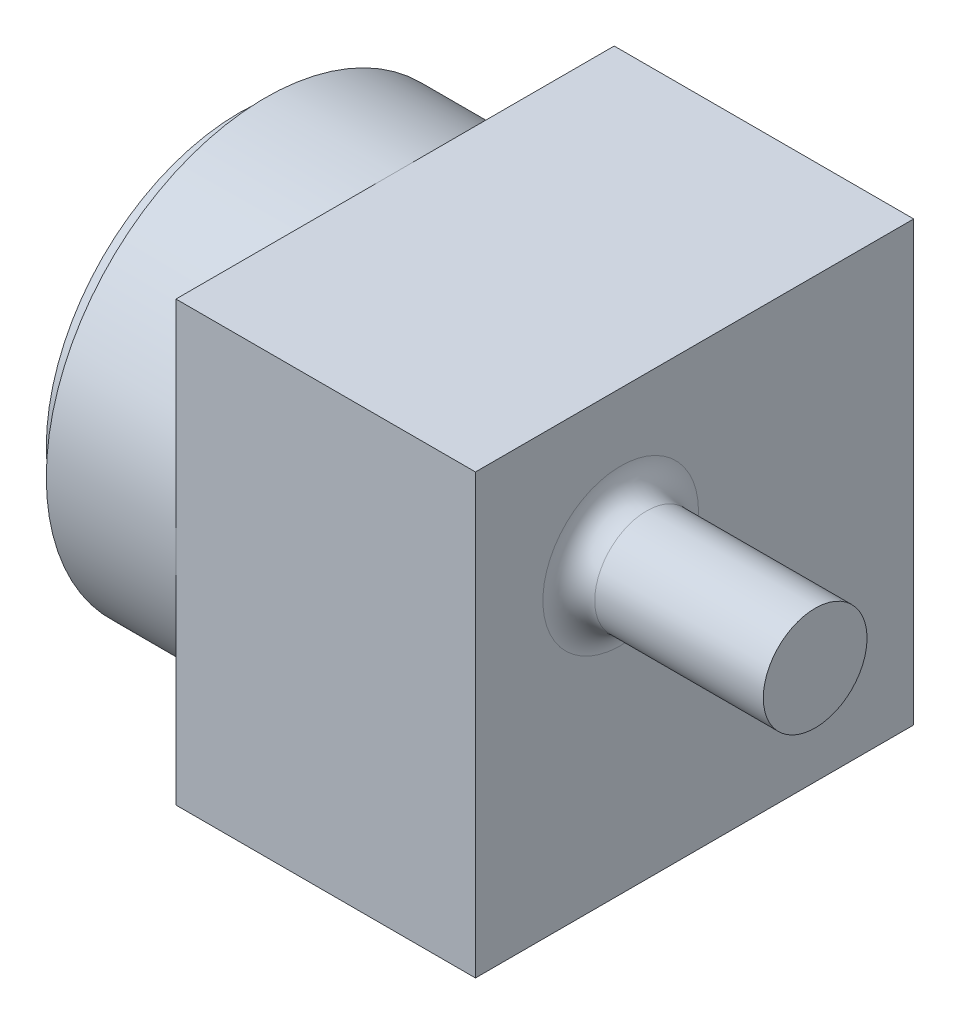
ISO-10303-21;
HEADER;
FILE_DESCRIPTION(('STEP AP214'),'2;1');
FILE_NAME('part.step','',(''),(''),'','','');
FILE_SCHEMA(('AUTOMOTIVE_DESIGN { 1 0 10303 214 1 1 1 1 }'));
ENDSEC;
DATA;
#1=APPLICATION_CONTEXT('core data for automotive mechanical design processes');
#2=APPLICATION_PROTOCOL_DEFINITION('international standard','automotive_design',2000,#1);
#3=PRODUCT_CONTEXT('',#1,'mechanical');
#4=PRODUCT('Part','Part','',(#3));
#5=PRODUCT_RELATED_PRODUCT_CATEGORY('part','',(#4));
#6=PRODUCT_DEFINITION_FORMATION('','',#4);
#7=PRODUCT_DEFINITION_CONTEXT('part definition',#1,'design');
#8=PRODUCT_DEFINITION('design','',#6,#7);
#9=PRODUCT_DEFINITION_SHAPE('','',#8);
#10=(LENGTH_UNIT() NAMED_UNIT(*) SI_UNIT(.MILLI.,.METRE.));
#11=(NAMED_UNIT(*) PLANE_ANGLE_UNIT() SI_UNIT($,.RADIAN.));
#12=(NAMED_UNIT(*) SI_UNIT($,.STERADIAN.) SOLID_ANGLE_UNIT());
#13=UNCERTAINTY_MEASURE_WITH_UNIT(LENGTH_MEASURE(1.E-05),#10,'distance_accuracy_value','');
#14=(GEOMETRIC_REPRESENTATION_CONTEXT(3) GLOBAL_UNCERTAINTY_ASSIGNED_CONTEXT((#13)) GLOBAL_UNIT_ASSIGNED_CONTEXT((#10,
#11,#12)) REPRESENTATION_CONTEXT('',''));
#15=CARTESIAN_POINT('',(0.,0.,0.));
#16=DIRECTION('',(0.,0.,1.));
#17=DIRECTION('',(1.,0.,0.));
#18=AXIS2_PLACEMENT_3D('',#15,#16,#17);
#19=CARTESIAN_POINT('',(5.86739999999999,8.5852,4.2926));
#20=DIRECTION('',(1.,0.,0.));
#21=DIRECTION('',(0.,0.,-1.));
#22=AXIS2_PLACEMENT_3D('',#19,#20,#21);
#23=PLANE('',#22);
#24=CARTESIAN_POINT('',(5.86739999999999,5.7404,1.44779999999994));
#25=DIRECTION('',(1.,0.,0.));
#26=DIRECTION('',(0.,0.,-1.));
#27=AXIS2_PLACEMENT_3D('',#24,#25,#26);
#28=CIRCLE('',#27,1.524);
#29=CARTESIAN_POINT('',(5.86739999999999,5.7404,-0.0762000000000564));
#30=VERTEX_POINT('',#29);
#31=EDGE_CURVE('E11',#30,#30,#28,.F.);
#32=ORIENTED_EDGE('',*,*,#31,.T.);
#33=EDGE_LOOP('',(#32));
#34=FACE_BOUND('',#33,.T.);
#35=DIRECTION('',(0.,-1.,0.));
#36=VECTOR('',#35,1.);
#37=CARTESIAN_POINT('',(5.86739999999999,8.5852,4.2926));
#38=LINE('',#37,#36);
#39=CARTESIAN_POINT('',(5.86739999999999,8.5852,4.2926));
#40=VERTEX_POINT('',#39);
#41=CARTESIAN_POINT('',(5.86739999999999,0.,4.29259999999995));
#42=VERTEX_POINT('',#41);
#43=EDGE_CURVE('E128',#40,#42,#38,.T.);
#44=ORIENTED_EDGE('',*,*,#43,.T.);
#45=DIRECTION('',(0.,0.,-1.));
#46=VECTOR('',#45,1.);
#47=CARTESIAN_POINT('',(5.86739999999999,0.,4.29259999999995));
#48=LINE('',#47,#46);
#49=CARTESIAN_POINT('',(5.86739999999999,0.,-4.2926));
#50=VERTEX_POINT('',#49);
#51=EDGE_CURVE('E131',#42,#50,#48,.T.);
#52=ORIENTED_EDGE('',*,*,#51,.T.);
#53=DIRECTION('',(0.,1.,0.));
#54=VECTOR('',#53,1.);
#55=CARTESIAN_POINT('',(5.86739999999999,8.5852,-4.2926));
#56=LINE('',#55,#54);
#57=CARTESIAN_POINT('',(5.86739999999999,8.5852,-4.2926));
#58=VERTEX_POINT('',#57);
#59=EDGE_CURVE('E133',#50,#58,#56,.T.);
#60=ORIENTED_EDGE('',*,*,#59,.T.);
#61=DIRECTION('',(0.,0.,1.));
#62=VECTOR('',#61,1.);
#63=CARTESIAN_POINT('',(5.86739999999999,8.5852,4.2926));
#64=LINE('',#63,#62);
#65=EDGE_CURVE('E135',#58,#40,#64,.T.);
#66=ORIENTED_EDGE('',*,*,#65,.T.);
#67=EDGE_LOOP('',(#44,#52,#60,#66));
#68=FACE_BOUND('',#67,.T.);
#69=ADVANCED_FACE('F30',(#34,#68),#23,.T.);
#70=CARTESIAN_POINT('',(-3.048,4.29260000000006,0.));
#71=DIRECTION('',(-1.,0.,0.));
#72=DIRECTION('',(0.,0.,1.));
#73=AXIS2_PLACEMENT_3D('',#70,#71,#72);
#74=PLANE('',#73);
#75=CARTESIAN_POINT('',(-3.048,4.29260000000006,0.));
#76=DIRECTION('',(-1.,0.,0.));
#77=DIRECTION('',(0.,0.,1.));
#78=AXIS2_PLACEMENT_3D('',#75,#76,#77);
#79=CIRCLE('',#78,3.7846);
#80=CARTESIAN_POINT('',(-3.048,4.29260000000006,3.78460000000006));
#81=VERTEX_POINT('',#80);
#82=EDGE_CURVE('E109',#81,#81,#79,.T.);
#83=ORIENTED_EDGE('',*,*,#82,.T.);
#84=EDGE_LOOP('',(#83));
#85=FACE_BOUND('',#84,.T.);
#86=CARTESIAN_POINT('',(-3.048,4.29260000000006,0.));
#87=DIRECTION('',(-1.,0.,0.));
#88=DIRECTION('',(0.,0.,1.));
#89=AXIS2_PLACEMENT_3D('',#86,#87,#88);
#90=CIRCLE('',#89,2.6924);
#91=CARTESIAN_POINT('',(-3.048,4.29260000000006,2.69240000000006));
#92=VERTEX_POINT('',#91);
#93=EDGE_CURVE('E350',#92,#92,#90,.T.);
#94=ORIENTED_EDGE('',*,*,#93,.F.);
#95=EDGE_LOOP('',(#94));
#96=FACE_BOUND('',#95,.T.);
#97=ADVANCED_FACE('F172',(#85,#96),#74,.T.);
#98=CARTESIAN_POINT('',(-2.54,4.29260000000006,0.));
#99=DIRECTION('',(-1.,0.,0.));
#100=DIRECTION('',(0.,0.,1.));
#101=AXIS2_PLACEMENT_3D('',#98,#99,#100);
#102=PLANE('',#101);
#103=CARTESIAN_POINT('',(-2.54,4.29260000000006,0.));
#104=DIRECTION('',(-1.,0.,0.));
#105=DIRECTION('',(0.,0.,1.));
#106=AXIS2_PLACEMENT_3D('',#103,#104,#105);
#107=CIRCLE('',#106,4.2926);
#108=CARTESIAN_POINT('',(-2.54,4.29260000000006,4.29260000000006));
#109=VERTEX_POINT('',#108);
#110=EDGE_CURVE('E101',#109,#109,#107,.T.);
#111=ORIENTED_EDGE('',*,*,#110,.T.);
#112=EDGE_LOOP('',(#111));
#113=FACE_BOUND('',#112,.T.);
#114=CARTESIAN_POINT('',(-2.54,4.29260000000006,0.));
#115=DIRECTION('',(-1.,0.,0.));
#116=DIRECTION('',(0.,0.,1.));
#117=AXIS2_PLACEMENT_3D('',#114,#115,#116);
#118=CIRCLE('',#117,3.7846);
#119=CARTESIAN_POINT('',(-2.54,4.29260000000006,3.78460000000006));
#120=VERTEX_POINT('',#119);
#121=EDGE_CURVE('E355',#120,#120,#118,.T.);
#122=ORIENTED_EDGE('',*,*,#121,.F.);
#123=EDGE_LOOP('',(#122));
#124=FACE_BOUND('',#123,.T.);
#125=ADVANCED_FACE('F177',(#113,#124),#102,.T.);
#126=CARTESIAN_POINT('',(0.,8.5852,4.2926));
#127=DIRECTION('',(1.,0.,0.));
#128=DIRECTION('',(0.,0.,-1.));
#129=AXIS2_PLACEMENT_3D('',#126,#127,#128);
#130=PLANE('',#129);
#131=CARTESIAN_POINT('',(0.,4.2926,0.));
#132=DIRECTION('',(-1.,0.,0.));
#133=DIRECTION('',(0.,0.,1.));
#134=AXIS2_PLACEMENT_3D('',#131,#132,#133);
#135=CIRCLE('',#134,4.2926);
#136=CARTESIAN_POINT('',(0.,4.29259999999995,4.29260000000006));
#137=VERTEX_POINT('',#136);
#138=CARTESIAN_POINT('',(0.,8.5852,0.));
#139=VERTEX_POINT('',#138);
#140=EDGE_CURVE('E103',#137,#139,#135,.T.);
#141=ORIENTED_EDGE('',*,*,#140,.F.);
#142=DIRECTION('',(0.,-1.,0.));
#143=VECTOR('',#142,1.);
#144=CARTESIAN_POINT('',(0.,8.5852,4.2926));
#145=LINE('',#144,#143);
#146=CARTESIAN_POINT('',(0.,8.5852,4.2926));
#147=VERTEX_POINT('',#146);
#148=EDGE_CURVE('E86',#147,#137,#145,.T.);
#149=ORIENTED_EDGE('',*,*,#148,.F.);
#150=DIRECTION('',(0.,0.,1.));
#151=VECTOR('',#150,1.);
#152=CARTESIAN_POINT('',(0.,8.5852,4.2926));
#153=LINE('',#152,#151);
#154=EDGE_CURVE('E105',#139,#147,#153,.T.);
#155=ORIENTED_EDGE('',*,*,#154,.F.);
#156=EDGE_LOOP('',(#141,#149,#155));
#157=FACE_BOUND('',#156,.T.);
#158=ADVANCED_FACE('F104',(#157),#130,.F.);
#159=CARTESIAN_POINT('',(0.,4.2926,-4.2926));
#160=VERTEX_POINT('',#159);
#161=EDGE_CURVE('E111',#139,#160,#135,.T.);
#162=ORIENTED_EDGE('',*,*,#161,.F.);
#163=CARTESIAN_POINT('',(0.,8.5852,-4.2926));
#164=VERTEX_POINT('',#163);
#165=EDGE_CURVE('E126',#164,#139,#153,.T.);
#166=ORIENTED_EDGE('',*,*,#165,.F.);
#167=DIRECTION('',(0.,1.,0.));
#168=VECTOR('',#167,1.);
#169=CARTESIAN_POINT('',(0.,8.5852,-4.2926));
#170=LINE('',#169,#168);
#171=EDGE_CURVE('E122',#160,#164,#170,.T.);
#172=ORIENTED_EDGE('',*,*,#171,.F.);
#173=EDGE_LOOP('',(#162,#166,#172));
#174=FACE_BOUND('',#173,.T.);
#175=ADVANCED_FACE('F147',(#174),#130,.F.);
#176=CARTESIAN_POINT('',(0.,0.,0.));
#177=VERTEX_POINT('',#176);
#178=EDGE_CURVE('E52',#160,#177,#135,.T.);
#179=ORIENTED_EDGE('',*,*,#178,.F.);
#180=CARTESIAN_POINT('',(0.,0.,-4.2926));
#181=VERTEX_POINT('',#180);
#182=EDGE_CURVE('E123',#181,#160,#170,.T.);
#183=ORIENTED_EDGE('',*,*,#182,.F.);
#184=DIRECTION('',(0.,0.,-1.));
#185=VECTOR('',#184,1.);
#186=CARTESIAN_POINT('',(0.,0.,4.2926));
#187=LINE('',#186,#185);
#188=EDGE_CURVE('E95',#177,#181,#187,.T.);
#189=ORIENTED_EDGE('',*,*,#188,.F.);
#190=EDGE_LOOP('',(#179,#183,#189));
#191=FACE_BOUND('',#190,.T.);
#192=ADVANCED_FACE('F153',(#191),#130,.F.);
#193=EDGE_CURVE('E45',#177,#137,#135,.T.);
#194=ORIENTED_EDGE('',*,*,#193,.F.);
#195=CARTESIAN_POINT('',(0.,0.,4.2926));
#196=VERTEX_POINT('',#195);
#197=EDGE_CURVE('E99',#196,#177,#187,.T.);
#198=ORIENTED_EDGE('',*,*,#197,.F.);
#199=EDGE_CURVE('E88',#137,#196,#145,.T.);
#200=ORIENTED_EDGE('',*,*,#199,.F.);
#201=EDGE_LOOP('',(#194,#198,#200));
#202=FACE_BOUND('',#201,.T.);
#203=ADVANCED_FACE('F97',(#202),#130,.F.);
#204=CARTESIAN_POINT('',(5.86739999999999,8.5852,4.2926));
#205=DIRECTION('',(0.,0.,-1.));
#206=DIRECTION('',(0.,1.,0.));
#207=AXIS2_PLACEMENT_3D('',#204,#205,#206);
#208=PLANE('',#207);
#209=ORIENTED_EDGE('',*,*,#148,.T.);
#210=ORIENTED_EDGE('',*,*,#199,.T.);
#211=DIRECTION('',(-1.,0.,0.));
#212=VECTOR('',#211,1.);
#213=CARTESIAN_POINT('',(5.86739999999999,0.,4.29259999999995));
#214=LINE('',#213,#212);
#215=EDGE_CURVE('E113',#42,#196,#214,.T.);
#216=ORIENTED_EDGE('',*,*,#215,.F.);
#217=ORIENTED_EDGE('',*,*,#43,.F.);
#218=DIRECTION('',(-1.,0.,0.));
#219=VECTOR('',#218,1.);
#220=CARTESIAN_POINT('',(5.86739999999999,8.5852,4.2926));
#221=LINE('',#220,#219);
#222=EDGE_CURVE('E91',#40,#147,#221,.T.);
#223=ORIENTED_EDGE('',*,*,#222,.T.);
#224=EDGE_LOOP('',(#209,#210,#216,#217,#223));
#225=FACE_BOUND('',#224,.T.);
#226=ADVANCED_FACE('F32',(#225),#208,.F.);
#227=CARTESIAN_POINT('',(5.86739999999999,0.,4.29259999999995));
#228=DIRECTION('',(0.,1.,0.));
#229=DIRECTION('',(0.,0.,1.));
#230=AXIS2_PLACEMENT_3D('',#227,#228,#229);
#231=PLANE('',#230);
#232=ORIENTED_EDGE('',*,*,#197,.T.);
#233=ORIENTED_EDGE('',*,*,#188,.T.);
#234=DIRECTION('',(-1.,0.,0.));
#235=VECTOR('',#234,1.);
#236=CARTESIAN_POINT('',(5.86739999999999,0.,-4.2926));
#237=LINE('',#236,#235);
#238=EDGE_CURVE('E114',#50,#181,#237,.T.);
#239=ORIENTED_EDGE('',*,*,#238,.F.);
#240=ORIENTED_EDGE('',*,*,#51,.F.);
#241=ORIENTED_EDGE('',*,*,#215,.T.);
#242=EDGE_LOOP('',(#232,#233,#239,#240,#241));
#243=FACE_BOUND('',#242,.T.);
#244=ADVANCED_FACE('F155',(#243),#231,.F.);
#245=CARTESIAN_POINT('',(5.86739999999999,8.5852,-4.2926));
#246=DIRECTION('',(0.,0.,1.));
#247=DIRECTION('',(0.,-1.,0.));
#248=AXIS2_PLACEMENT_3D('',#245,#246,#247);
#249=PLANE('',#248);
#250=ORIENTED_EDGE('',*,*,#182,.T.);
#251=ORIENTED_EDGE('',*,*,#171,.T.);
#252=DIRECTION('',(-1.,0.,0.));
#253=VECTOR('',#252,1.);
#254=CARTESIAN_POINT('',(5.86739999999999,8.5852,-4.2926));
#255=LINE('',#254,#253);
#256=EDGE_CURVE('E138',#58,#164,#255,.T.);
#257=ORIENTED_EDGE('',*,*,#256,.F.);
#258=ORIENTED_EDGE('',*,*,#59,.F.);
#259=ORIENTED_EDGE('',*,*,#238,.T.);
#260=EDGE_LOOP('',(#250,#251,#257,#258,#259));
#261=FACE_BOUND('',#260,.T.);
#262=ADVANCED_FACE('F150',(#261),#249,.F.);
#263=CARTESIAN_POINT('',(5.86739999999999,8.5852,4.2926));
#264=DIRECTION('',(0.,-1.,0.));
#265=DIRECTION('',(0.,0.,-1.));
#266=AXIS2_PLACEMENT_3D('',#263,#264,#265);
#267=PLANE('',#266);
#268=ORIENTED_EDGE('',*,*,#165,.T.);
#269=ORIENTED_EDGE('',*,*,#154,.T.);
#270=ORIENTED_EDGE('',*,*,#222,.F.);
#271=ORIENTED_EDGE('',*,*,#65,.F.);
#272=ORIENTED_EDGE('',*,*,#256,.T.);
#273=EDGE_LOOP('',(#268,#269,#270,#271,#272));
#274=FACE_BOUND('',#273,.T.);
#275=ADVANCED_FACE('F159',(#274),#267,.F.);
#276=CARTESIAN_POINT('',(-2.54,4.29260000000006,0.));
#277=DIRECTION('',(1.,0.,0.));
#278=DIRECTION('',(0.,0.,-1.));
#279=AXIS2_PLACEMENT_3D('',#276,#277,#278);
#280=CYLINDRICAL_SURFACE('',#279,4.2926);
#281=ORIENTED_EDGE('',*,*,#110,.F.);
#282=EDGE_LOOP('',(#281));
#283=FACE_BOUND('',#282,.T.);
#284=ORIENTED_EDGE('',*,*,#140,.T.);
#285=ORIENTED_EDGE('',*,*,#161,.T.);
#286=ORIENTED_EDGE('',*,*,#178,.T.);
#287=ORIENTED_EDGE('',*,*,#193,.T.);
#288=EDGE_LOOP('',(#284,#285,#286,#287));
#289=FACE_BOUND('',#288,.T.);
#290=ADVANCED_FACE('F112',(#283,#289),#280,.T.);
#291=CARTESIAN_POINT('',(-3.048,4.29260000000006,0.));
#292=DIRECTION('',(1.,0.,0.));
#293=DIRECTION('',(0.,0.,-1.));
#294=AXIS2_PLACEMENT_3D('',#291,#292,#293);
#295=CYLINDRICAL_SURFACE('',#294,3.7846);
#296=ORIENTED_EDGE('',*,*,#82,.F.);
#297=EDGE_LOOP('',(#296));
#298=FACE_BOUND('',#297,.T.);
#299=ORIENTED_EDGE('',*,*,#121,.T.);
#300=EDGE_LOOP('',(#299));
#301=FACE_BOUND('',#300,.T.);
#302=ADVANCED_FACE('F166',(#298,#301),#295,.T.);
#303=CARTESIAN_POINT('',(-3.048,4.29260000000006,0.));
#304=DIRECTION('',(1.,0.,0.));
#305=DIRECTION('',(0.,0.,1.));
#306=AXIS2_PLACEMENT_3D('',#303,#304,#305);
#307=CONICAL_SURFACE('',#306,2.6924,0.78539816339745);
#308=CARTESIAN_POINT('',(-3.88620000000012,4.29260000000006,0.));
#309=DIRECTION('',(-1.,0.,0.));
#310=DIRECTION('',(0.,0.,1.));
#311=AXIS2_PLACEMENT_3D('',#308,#309,#310);
#312=CIRCLE('',#311,1.8542);
#313=CARTESIAN_POINT('',(-3.88620000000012,4.29260000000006,1.85420000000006));
#314=VERTEX_POINT('',#313);
#315=EDGE_CURVE('E353',#314,#314,#312,.T.);
#316=ORIENTED_EDGE('',*,*,#315,.F.);
#317=EDGE_LOOP('',(#316));
#318=FACE_BOUND('',#317,.T.);
#319=ORIENTED_EDGE('',*,*,#93,.T.);
#320=EDGE_LOOP('',(#319));
#321=FACE_BOUND('',#320,.T.);
#322=ADVANCED_FACE('F187',(#318,#321),#307,.T.);
#323=CARTESIAN_POINT('',(-3.88620000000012,4.29260000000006,0.));
#324=DIRECTION('',(-1.,0.,0.));
#325=DIRECTION('',(0.,0.,1.));
#326=AXIS2_PLACEMENT_3D('',#323,#324,#325);
#327=PLANE('',#326);
#328=CARTESIAN_POINT('',(-3.88620000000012,4.29260000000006,0.));
#329=DIRECTION('',(-1.,0.,0.));
#330=DIRECTION('',(0.,0.,1.));
#331=AXIS2_PLACEMENT_3D('',#328,#329,#330);
#332=CIRCLE('',#331,0.635);
#333=CARTESIAN_POINT('',(-3.88620000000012,4.29260000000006,0.635000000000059));
#334=VERTEX_POINT('',#333);
#335=EDGE_CURVE('E342',#334,#334,#332,.T.);
#336=ORIENTED_EDGE('',*,*,#335,.F.);
#337=EDGE_LOOP('',(#336));
#338=FACE_BOUND('',#337,.T.);
#339=ORIENTED_EDGE('',*,*,#315,.T.);
#340=EDGE_LOOP('',(#339));
#341=FACE_BOUND('',#340,.T.);
#342=ADVANCED_FACE('F192',(#338,#341),#327,.T.);
#343=CARTESIAN_POINT('',(-3.88620000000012,4.29260000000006,0.));
#344=DIRECTION('',(-1.,0.,0.));
#345=DIRECTION('',(0.,0.,1.));
#346=AXIS2_PLACEMENT_3D('',#343,#344,#345);
#347=CONICAL_SURFACE('',#346,0.635,0.5235987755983);
#348=CARTESIAN_POINT('',(-3.6322,4.29260000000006,0.));
#349=DIRECTION('',(-1.,0.,0.));
#350=DIRECTION('',(0.,0.,1.));
#351=AXIS2_PLACEMENT_3D('',#348,#349,#350);
#352=CIRCLE('',#351,0.488353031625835);
#353=CARTESIAN_POINT('',(-3.6322,4.29260000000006,0.488353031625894));
#354=VERTEX_POINT('',#353);
#355=EDGE_CURVE('E345',#354,#354,#352,.T.);
#356=ORIENTED_EDGE('',*,*,#355,.F.);
#357=EDGE_LOOP('',(#356));
#358=FACE_BOUND('',#357,.T.);
#359=ORIENTED_EDGE('',*,*,#335,.T.);
#360=EDGE_LOOP('',(#359));
#361=FACE_BOUND('',#360,.T.);
#362=ADVANCED_FACE('F196',(#358,#361),#347,.F.);
#363=CARTESIAN_POINT('',(-3.6322,4.29260000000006,0.));
#364=DIRECTION('',(-1.,0.,0.));
#365=DIRECTION('',(0.,0.,1.));
#366=AXIS2_PLACEMENT_3D('',#363,#364,#365);
#367=PLANE('',#366);
#368=ORIENTED_EDGE('',*,*,#355,.T.);
#369=EDGE_LOOP('',(#368));
#370=FACE_BOUND('',#369,.T.);
#371=ADVANCED_FACE('F200',(#370),#367,.T.);
#372=CARTESIAN_POINT('',(9.6774,5.7404,1.4478));
#373=DIRECTION('',(-1.,0.,0.));
#374=DIRECTION('',(0.,0.,1.));
#375=AXIS2_PLACEMENT_3D('',#372,#373,#374);
#376=CYLINDRICAL_SURFACE('',#375,1.016);
#377=CARTESIAN_POINT('',(6.3754,5.7404,1.44779999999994));
#378=DIRECTION('',(1.,0.,0.));
#379=DIRECTION('',(0.,0.,-1.));
#380=AXIS2_PLACEMENT_3D('',#377,#378,#379);
#381=CIRCLE('',#380,1.016);
#382=CARTESIAN_POINT('',(6.3754,5.7404,2.4638));
#383=VERTEX_POINT('',#382);
#384=EDGE_CURVE('E38',#383,#383,#381,.T.);
#385=CARTESIAN_POINT('',(9.6774,5.7404,1.4478));
#386=DIRECTION('',(1.,0.,0.));
#387=DIRECTION('',(0.,0.,-1.));
#388=AXIS2_PLACEMENT_3D('',#385,#386,#387);
#389=CIRCLE('',#388,1.016);
#390=CARTESIAN_POINT('',(9.6774,5.7404,2.4638));
#391=VERTEX_POINT('',#390);
#392=EDGE_CURVE('E340',#391,#391,#389,.T.);
#393=CARTESIAN_POINT('',(6.3754,5.7404,2.4638));
#394=CARTESIAN_POINT('',(6.40979583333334,5.7404,2.4638));
#395=CARTESIAN_POINT('',(6.44419166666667,5.7404,2.4638));
#396=CARTESIAN_POINT('',(6.51298333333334,5.7404,2.4638));
#397=CARTESIAN_POINT('',(6.54737916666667,5.7404,2.4638));
#398=CARTESIAN_POINT('',(6.61617083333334,5.7404,2.4638));
#399=CARTESIAN_POINT('',(6.65056666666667,5.7404,2.4638));
#400=CARTESIAN_POINT('',(6.71935833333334,5.7404,2.4638));
#401=CARTESIAN_POINT('',(6.75375416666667,5.7404,2.4638));
#402=CARTESIAN_POINT('',(6.82254583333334,5.7404,2.4638));
#403=CARTESIAN_POINT('',(6.85694166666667,5.7404,2.4638));
#404=CARTESIAN_POINT('',(6.92573333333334,5.7404,2.4638));
#405=CARTESIAN_POINT('',(6.96012916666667,5.7404,2.4638));
#406=CARTESIAN_POINT('',(7.02892083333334,5.7404,2.4638));
#407=CARTESIAN_POINT('',(7.06331666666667,5.7404,2.4638));
#408=CARTESIAN_POINT('',(7.13210833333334,5.7404,2.4638));
#409=CARTESIAN_POINT('',(7.16650416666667,5.7404,2.4638));
#410=CARTESIAN_POINT('',(7.23529583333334,5.7404,2.4638));
#411=CARTESIAN_POINT('',(7.26969166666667,5.7404,2.4638));
#412=CARTESIAN_POINT('',(7.33848333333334,5.7404,2.4638));
#413=CARTESIAN_POINT('',(7.37287916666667,5.7404,2.4638));
#414=CARTESIAN_POINT('',(7.44167083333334,5.7404,2.4638));
#415=CARTESIAN_POINT('',(7.47606666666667,5.7404,2.4638));
#416=CARTESIAN_POINT('',(7.54485833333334,5.7404,2.4638));
#417=CARTESIAN_POINT('',(7.57925416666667,5.7404,2.4638));
#418=CARTESIAN_POINT('',(7.64804583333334,5.7404,2.4638));
#419=CARTESIAN_POINT('',(7.68244166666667,5.7404,2.4638));
#420=CARTESIAN_POINT('',(7.75123333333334,5.7404,2.4638));
#421=CARTESIAN_POINT('',(7.78562916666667,5.7404,2.4638));
#422=CARTESIAN_POINT('',(7.85442083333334,5.7404,2.4638));
#423=CARTESIAN_POINT('',(7.88881666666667,5.7404,2.4638));
#424=CARTESIAN_POINT('',(7.95760833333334,5.7404,2.4638));
#425=CARTESIAN_POINT('',(7.99200416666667,5.7404,2.4638));
#426=CARTESIAN_POINT('',(8.06079583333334,5.7404,2.4638));
#427=CARTESIAN_POINT('',(8.09519166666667,5.7404,2.4638));
#428=CARTESIAN_POINT('',(8.16398333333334,5.7404,2.4638));
#429=CARTESIAN_POINT('',(8.19837916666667,5.7404,2.4638));
#430=CARTESIAN_POINT('',(8.26717083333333,5.7404,2.4638));
#431=CARTESIAN_POINT('',(8.30156666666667,5.7404,2.4638));
#432=CARTESIAN_POINT('',(8.37035833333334,5.7404,2.4638));
#433=CARTESIAN_POINT('',(8.40475416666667,5.7404,2.4638));
#434=CARTESIAN_POINT('',(8.47354583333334,5.7404,2.4638));
#435=CARTESIAN_POINT('',(8.50794166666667,5.7404,2.4638));
#436=CARTESIAN_POINT('',(8.57673333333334,5.7404,2.4638));
#437=CARTESIAN_POINT('',(8.61112916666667,5.7404,2.4638));
#438=CARTESIAN_POINT('',(8.67992083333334,5.7404,2.4638));
#439=CARTESIAN_POINT('',(8.71431666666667,5.7404,2.4638));
#440=CARTESIAN_POINT('',(8.78310833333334,5.7404,2.4638));
#441=CARTESIAN_POINT('',(8.81750416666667,5.7404,2.4638));
#442=CARTESIAN_POINT('',(8.88629583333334,5.7404,2.4638));
#443=CARTESIAN_POINT('',(8.92069166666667,5.7404,2.4638));
#444=CARTESIAN_POINT('',(8.98948333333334,5.7404,2.4638));
#445=CARTESIAN_POINT('',(9.02387916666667,5.7404,2.4638));
#446=CARTESIAN_POINT('',(9.09267083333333,5.7404,2.4638));
#447=CARTESIAN_POINT('',(9.12706666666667,5.7404,2.4638));
#448=CARTESIAN_POINT('',(9.19585833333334,5.7404,2.4638));
#449=CARTESIAN_POINT('',(9.23025416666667,5.7404,2.4638));
#450=CARTESIAN_POINT('',(9.29904583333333,5.7404,2.4638));
#451=CARTESIAN_POINT('',(9.33344166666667,5.7404,2.4638));
#452=CARTESIAN_POINT('',(9.40223333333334,5.7404,2.4638));
#453=CARTESIAN_POINT('',(9.43662916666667,5.7404,2.4638));
#454=CARTESIAN_POINT('',(9.50542083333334,5.7404,2.4638));
#455=CARTESIAN_POINT('',(9.53981666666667,5.7404,2.4638));
#456=CARTESIAN_POINT('',(9.60860833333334,5.7404,2.4638));
#457=CARTESIAN_POINT('',(9.64300416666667,5.7404,2.4638));
#458=CARTESIAN_POINT('',(9.6774,5.7404,2.4638));
#459=B_SPLINE_CURVE_WITH_KNOTS('',3,(#393,#394,#395,#396,#397,#398,#399,#400,#401,#402,#403,
#404,#405,#406,#407,#408,#409,#410,#411,#412,#413,#414,#415,#416,#417,#418,#419,#420,#421,#422,
#423,#424,#425,#426,#427,#428,#429,#430,#431,#432,#433,#434,#435,#436,#437,#438,#439,#440,#441,
#442,#443,#444,#445,#446,#447,#448,#449,#450,#451,#452,#453,#454,#455,#456,#457,#458),
.UNSPECIFIED.,.F.,.F.,(4,2,2,2,2,2,2,2,2,2,2,2,2,2,2,2,2,2,2,2,2,2,2,2,2,2,2,2,2,2,2,2,4),(0.,
0.103187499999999,0.206375,0.309562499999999,0.41275,0.515937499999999,0.619125,
0.722312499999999,0.8255,0.928687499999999,1.031875,1.1350625,1.23825,1.3414375,1.444625,
1.5478125,1.651,1.7541875,1.857375,1.9605625,2.06375,2.1669375,2.270125,2.3733125,2.4765,
2.5796875,2.682875,2.7860625,2.88925,2.9924375,3.095625,3.1988125,3.302),.UNSPECIFIED.);
#460=EDGE_CURVE('BSEAM204',#383,#391,#459,.T.);
#461=ORIENTED_EDGE('',*,*,#384,.T.);
#462=ORIENTED_EDGE('',*,*,#392,.F.);
#463=ORIENTED_EDGE('',*,*,#460,.T.);
#464=ORIENTED_EDGE('',*,*,#460,.F.);
#465=EDGE_LOOP('',(#461,#463,#462,#464));
#466=FACE_BOUND('',#465,.T.);
#467=ADVANCED_FACE('F204',(#466),#376,.T.);
#468=CARTESIAN_POINT('',(9.6774,5.7404,1.4478));
#469=DIRECTION('',(1.,0.,0.));
#470=DIRECTION('',(0.,0.,-1.));
#471=AXIS2_PLACEMENT_3D('',#468,#469,#470);
#472=PLANE('',#471);
#473=ORIENTED_EDGE('',*,*,#392,.T.);
#474=EDGE_LOOP('',(#473));
#475=FACE_BOUND('',#474,.T.);
#476=ADVANCED_FACE('F208',(#475),#472,.T.);
#477=CARTESIAN_POINT('',(6.3754,5.7404,1.44779999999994));
#478=DIRECTION('',(1.,0.,0.));
#479=DIRECTION('',(0.,0.,-1.));
#480=AXIS2_PLACEMENT_3D('',#477,#478,#479);
#481=TOROIDAL_SURFACE('',#480,1.524,0.508);
#482=ORIENTED_EDGE('',*,*,#31,.F.);
#483=EDGE_LOOP('',(#482));
#484=FACE_BOUND('',#483,.T.);
#485=ORIENTED_EDGE('',*,*,#384,.F.);
#486=EDGE_LOOP('',(#485));
#487=FACE_BOUND('',#486,.T.);
#488=ADVANCED_FACE('F211',(#484,#487),#481,.F.);
#489=CLOSED_SHELL('',(#69,#97,#125,#158,#175,#192,#203,#226,#244,#262,#275,#290,#302,#322,#342,
#362,#371,#467,#476,#488));
#490=MANIFOLD_SOLID_BREP('B2',#489);
#491=ADVANCED_BREP_SHAPE_REPRESENTATION('',(#18,#490),#14);
#492=SHAPE_DEFINITION_REPRESENTATION(#9,#491);
ENDSEC;
END-ISO-10303-21;
